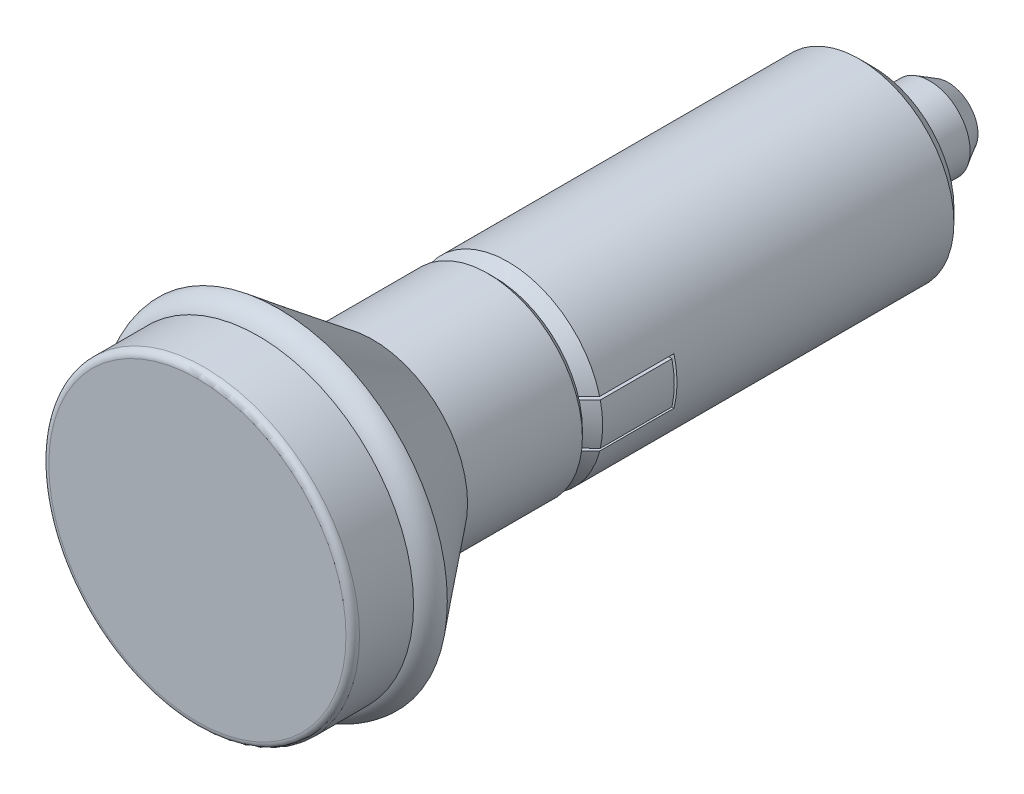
ISO-10303-21;
HEADER;
FILE_DESCRIPTION(('STEP AP214'),'2;1');
FILE_NAME('part.step','',(''),(''),'','','');
FILE_SCHEMA(('AUTOMOTIVE_DESIGN { 1 0 10303 214 1 1 1 1 }'));
ENDSEC;
DATA;
#1=APPLICATION_CONTEXT('core data for automotive mechanical design processes');
#2=APPLICATION_PROTOCOL_DEFINITION('international standard','automotive_design',2000,#1);
#3=PRODUCT_CONTEXT('',#1,'mechanical');
#4=PRODUCT('Part','Part','',(#3));
#5=PRODUCT_RELATED_PRODUCT_CATEGORY('part','',(#4));
#6=PRODUCT_DEFINITION_FORMATION('','',#4);
#7=PRODUCT_DEFINITION_CONTEXT('part definition',#1,'design');
#8=PRODUCT_DEFINITION('design','',#6,#7);
#9=PRODUCT_DEFINITION_SHAPE('','',#8);
#10=(LENGTH_UNIT() NAMED_UNIT(*) SI_UNIT(.MILLI.,.METRE.));
#11=(NAMED_UNIT(*) PLANE_ANGLE_UNIT() SI_UNIT($,.RADIAN.));
#12=(NAMED_UNIT(*) SI_UNIT($,.STERADIAN.) SOLID_ANGLE_UNIT());
#13=UNCERTAINTY_MEASURE_WITH_UNIT(LENGTH_MEASURE(1.E-05),#10,'distance_accuracy_value','');
#14=(GEOMETRIC_REPRESENTATION_CONTEXT(3) GLOBAL_UNCERTAINTY_ASSIGNED_CONTEXT((#13)) GLOBAL_UNIT_ASSIGNED_CONTEXT((#10,
#11,#12)) REPRESENTATION_CONTEXT('',''));
#15=CARTESIAN_POINT('',(0.,0.,0.));
#16=DIRECTION('',(0.,0.,1.));
#17=DIRECTION('',(1.,0.,0.));
#18=AXIS2_PLACEMENT_3D('',#15,#16,#17);
#19=CARTESIAN_POINT('',(0.,0.,27.9999999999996));
#20=DIRECTION('',(0.,0.,-1.));
#21=DIRECTION('',(-1.,0.,0.));
#22=AXIS2_PLACEMENT_3D('',#19,#20,#21);
#23=CONICAL_SURFACE('',#22,6.,0.785398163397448);
#24=CARTESIAN_POINT('',(0.,0.,26.9999999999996));
#25=DIRECTION('',(0.,0.,1.));
#26=DIRECTION('',(1.,0.,0.));
#27=AXIS2_PLACEMENT_3D('',#24,#25,#26);
#28=CIRCLE('',#27,7.);
#29=CARTESIAN_POINT('',(-6.77772085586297,-1.75,26.9999999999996));
#30=VERTEX_POINT('',#29);
#31=CARTESIAN_POINT('',(6.77772085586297,-1.75,26.9999999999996));
#32=VERTEX_POINT('',#31);
#33=EDGE_CURVE('E274',#30,#32,#28,.T.);
#34=ORIENTED_EDGE('',*,*,#33,.T.);
#35=CARTESIAN_POINT('',(11.806308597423,-1.75,22.0646984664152));
#36=CARTESIAN_POINT('',(11.3510637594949,-1.75,22.5149692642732));
#37=CARTESIAN_POINT('',(10.8955896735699,-1.75,22.9650092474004));
#38=CARTESIAN_POINT('',(9.98382441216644,-1.75,23.8642578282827));
#39=CARTESIAN_POINT('',(9.52753323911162,-1.75,24.3134664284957));
#40=CARTESIAN_POINT('',(8.61387315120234,-1.75,25.2105863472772));
#41=CARTESIAN_POINT('',(8.15650449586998,-1.75,25.6584979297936));
#42=CARTESIAN_POINT('',(7.46900337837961,-1.75,26.328887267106));
#43=CARTESIAN_POINT('',(7.23959330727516,-1.75,26.5521056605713));
#44=CARTESIAN_POINT('',(6.78013505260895,-1.75,26.9978845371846));
#45=CARTESIAN_POINT('',(6.55008686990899,-1.75,27.2204450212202));
#46=CARTESIAN_POINT('',(6.05652116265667,-1.75,27.6961117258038));
#47=CARTESIAN_POINT('',(5.79287414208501,-1.75,27.9490836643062));
#48=CARTESIAN_POINT('',(5.26397799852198,-1.75,28.4533312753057));
#49=CARTESIAN_POINT('',(4.99872893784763,-1.75,28.7046070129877));
#50=CARTESIAN_POINT('',(4.59896265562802,-1.75,29.0795479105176));
#51=CARTESIAN_POINT('',(4.465380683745,-1.75,29.2042096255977));
#52=CARTESIAN_POINT('',(4.19741399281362,-1.75,29.4526639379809));
#53=CARTESIAN_POINT('',(4.06302928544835,-1.75,29.5764565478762));
#54=CARTESIAN_POINT('',(3.79321215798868,-1.75,29.8229312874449));
#55=CARTESIAN_POINT('',(3.65777961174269,-1.75,29.9456132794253));
#56=CARTESIAN_POINT('',(3.38550244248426,-1.75,30.1894123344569));
#57=CARTESIAN_POINT('',(3.24865774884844,-1.75,30.310529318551));
#58=CARTESIAN_POINT('',(3.11092345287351,-1.75,30.4306380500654));
#59=B_SPLINE_CURVE_WITH_KNOTS('',3,(#35,#36,#37,#38,#39,#40,#41,#42,#43,#44,#45,#46,#47,#48,#49,
#50,#51,#52,#53,#54,#55,#56,#57,#58),.UNSPECIFIED.,.F.,.F.,(4,2,2,2,2,2,2,2,2,2,2,4),(0.,
1.92091856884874,3.84183144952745,5.76232122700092,6.72258010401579,7.68283768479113,
8.7789818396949,9.87508362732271,10.4232249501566,10.971358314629,11.5195587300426,
12.0677866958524),.UNSPECIFIED.);
#60=CARTESIAN_POINT('',(5.73912014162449,-1.75,27.9999999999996));
#61=VERTEX_POINT('',#60);
#62=EDGE_CURVE('E342',#32,#61,#59,.T.);
#63=ORIENTED_EDGE('',*,*,#62,.T.);
#64=CARTESIAN_POINT('',(0.,0.,27.9999999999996));
#65=DIRECTION('',(0.,0.,1.));
#66=DIRECTION('',(1.,0.,0.));
#67=AXIS2_PLACEMENT_3D('',#64,#65,#66);
#68=CIRCLE('',#67,6.);
#69=CARTESIAN_POINT('',(-5.73912014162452,-1.75,27.9999999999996));
#70=VERTEX_POINT('',#69);
#71=EDGE_CURVE('E279',#70,#61,#68,.T.);
#72=ORIENTED_EDGE('',*,*,#71,.F.);
#73=CARTESIAN_POINT('',(-10.6376253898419,-1.75,23.2193889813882));
#74=CARTESIAN_POINT('',(-10.4315589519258,-1.75,23.4227203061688));
#75=CARTESIAN_POINT('',(-10.2254167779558,-1.75,23.6259749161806));
#76=CARTESIAN_POINT('',(-9.81294587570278,-1.75,24.0322951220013));
#77=CARTESIAN_POINT('',(-9.60661714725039,-1.75,24.2353607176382));
#78=CARTESIAN_POINT('',(-8.98729385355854,-1.75,24.8442251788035));
#79=CARTESIAN_POINT('',(-8.57396738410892,-1.75,25.249686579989));
#80=CARTESIAN_POINT('',(-7.74610193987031,-1.75,26.0591581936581));
#81=CARTESIAN_POINT('',(-7.3315633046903,-1.75,26.463168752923));
#82=CARTESIAN_POINT('',(-6.70814620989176,-1.75,27.0675276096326));
#83=CARTESIAN_POINT('',(-6.50007172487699,-1.75,27.2687049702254));
#84=CARTESIAN_POINT('',(-6.0832118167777,-1.75,27.6703216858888));
#85=CARTESIAN_POINT('',(-5.87442639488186,-1.75,27.8707610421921));
#86=CARTESIAN_POINT('',(-5.45833219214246,-1.75,28.2683192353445));
#87=CARTESIAN_POINT('',(-5.25103443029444,-1.75,28.4654495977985));
#88=CARTESIAN_POINT('',(-4.83515975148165,-1.75,28.8583472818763));
#89=CARTESIAN_POINT('',(-4.62658287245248,-1.75,29.0541146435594));
#90=CARTESIAN_POINT('',(-4.31231196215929,-1.75,29.346285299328));
#91=CARTESIAN_POINT('',(-4.20731290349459,-1.75,29.4434359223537));
#92=CARTESIAN_POINT('',(-3.99674456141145,-1.75,29.637115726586));
#93=CARTESIAN_POINT('',(-3.89117528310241,-1.75,29.7336449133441));
#94=CARTESIAN_POINT('',(-3.67932633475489,-1.75,29.9259417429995));
#95=CARTESIAN_POINT('',(-3.57304660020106,-1.75,30.0217093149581));
#96=CARTESIAN_POINT('',(-3.35959032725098,-1.75,30.2122456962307));
#97=CARTESIAN_POINT('',(-3.25241376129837,-1.75,30.3070144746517));
#98=CARTESIAN_POINT('',(-3.14469403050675,-1.75,30.4011667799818));
#99=B_SPLINE_CURVE_WITH_KNOTS('',3,(#73,#74,#75,#76,#77,#78,#79,#80,#81,#82,#83,#84,#85,#86,#87,
#88,#89,#90,#91,#92,#93,#94,#95,#96,#97,#98),.UNSPECIFIED.,.F.,.F.,(4,2,2,2,2,2,2,2,2,2,2,2,4),
(0.,0.868483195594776,1.73696718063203,3.47395709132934,5.21049974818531,6.07877603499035,
6.94705087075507,7.8052398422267,8.66340348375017,9.09254883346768,9.52169034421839,
9.95087136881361,10.380065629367),.UNSPECIFIED.);
#100=EDGE_CURVE('E413',#30,#70,#99,.T.);
#101=ORIENTED_EDGE('',*,*,#100,.F.);
#102=EDGE_LOOP('',(#34,#63,#72,#101));
#103=FACE_BOUND('',#102,.T.);
#104=ADVANCED_FACE('F14',(#103),#23,.T.);
#105=CARTESIAN_POINT('',(5.79633504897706,-1.55,27.9999999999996));
#106=VERTEX_POINT('',#105);
#107=CARTESIAN_POINT('',(5.79633504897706,1.55,27.9999999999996));
#108=VERTEX_POINT('',#107);
#109=EDGE_CURVE('E283',#106,#108,#68,.T.);
#110=ORIENTED_EDGE('',*,*,#109,.F.);
#111=CARTESIAN_POINT('',(2.46323333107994,-1.55,31.0896703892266));
#112=CARTESIAN_POINT('',(2.57178180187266,-1.55,30.9977428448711));
#113=CARTESIAN_POINT('',(2.67952953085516,-1.55,30.9048825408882));
#114=CARTESIAN_POINT('',(2.89374241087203,-1.55,30.7177073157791));
#115=CARTESIAN_POINT('',(3.000207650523,-1.55,30.6233924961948));
#116=CARTESIAN_POINT('',(3.21217227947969,-1.55,30.4337216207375));
#117=CARTESIAN_POINT('',(3.31767182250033,-1.55,30.3383657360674));
#118=CARTESIAN_POINT('',(3.52792710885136,-1.55,30.1468338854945));
#119=CARTESIAN_POINT('',(3.63268283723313,-1.55,30.050657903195));
#120=CARTESIAN_POINT('',(3.94602010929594,-1.55,29.7612350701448));
#121=CARTESIAN_POINT('',(4.15372777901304,-1.55,29.5670428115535));
#122=CARTESIAN_POINT('',(4.56762785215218,-1.55,29.1770377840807));
#123=CARTESIAN_POINT('',(4.77382019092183,-1.55,28.9812249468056));
#124=CARTESIAN_POINT('',(5.09376751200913,-1.55,28.675732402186));
#125=CARTESIAN_POINT('',(5.20789003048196,-1.55,28.566437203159));
#126=CARTESIAN_POINT('',(5.43585922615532,-1.55,28.3475626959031));
#127=CARTESIAN_POINT('',(5.5497059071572,-1.55,28.2379833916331));
#128=CARTESIAN_POINT('',(5.89092091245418,-1.55,27.9088719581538));
#129=CARTESIAN_POINT('',(6.11794584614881,-1.55,27.6889838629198));
#130=CARTESIAN_POINT('',(6.80211048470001,-1.55,27.0243787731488));
#131=CARTESIAN_POINT('',(7.25825730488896,-1.55,26.5786404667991));
#132=CARTESIAN_POINT('',(8.16907069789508,-1.55,25.6856533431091));
#133=CARTESIAN_POINT('',(8.62373726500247,-1.55,25.2384045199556));
#134=CARTESIAN_POINT('',(9.53199750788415,-1.55,24.3431073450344));
#135=CARTESIAN_POINT('',(9.98559147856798,-1.55,23.8950592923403));
#136=CARTESIAN_POINT('',(10.8921339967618,-1.55,22.9983203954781));
#137=CARTESIAN_POINT('',(11.3450825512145,-1.55,22.5496295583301));
#138=CARTESIAN_POINT('',(11.7978546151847,-1.55,22.1007616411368));
#139=B_SPLINE_CURVE_WITH_KNOTS('',3,(#111,#112,#113,#114,#115,#116,#117,#118,#119,#120,#121,
#122,#123,#124,#125,#126,#127,#128,#129,#130,#131,#132,#133,#134,#135,#136,#137,#138),
.UNSPECIFIED.,.F.,.F.,(4,2,2,2,2,2,2,2,2,2,2,2,2,4),(0.,0.426715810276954,0.853401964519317,
1.28001897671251,1.70664453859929,2.55966932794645,3.41273030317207,3.8867809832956,
4.36082509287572,5.30898950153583,7.22229676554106,9.13561140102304,11.0483183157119,
12.9610044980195),.UNSPECIFIED.);
#140=CARTESIAN_POINT('',(6.82623615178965,-1.55,26.9999999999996));
#141=VERTEX_POINT('',#140);
#142=EDGE_CURVE('E335',#106,#141,#139,.T.);
#143=ORIENTED_EDGE('',*,*,#142,.T.);
#144=CARTESIAN_POINT('',(6.82623615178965,1.55,26.9999999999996));
#145=VERTEX_POINT('',#144);
#146=EDGE_CURVE('E278',#141,#145,#28,.T.);
#147=ORIENTED_EDGE('',*,*,#146,.T.);
#148=CARTESIAN_POINT('',(11.7978546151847,1.55,22.1007616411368));
#149=CARTESIAN_POINT('',(11.3449521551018,1.55,22.5497594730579));
#150=CARTESIAN_POINT('',(10.8918726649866,1.55,22.9985795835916));
#151=CARTESIAN_POINT('',(9.98508449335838,1.55,23.8955600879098));
#152=CARTESIAN_POINT('',(9.53137582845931,1.55,24.3437204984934));
#153=CARTESIAN_POINT('',(8.62313128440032,1.55,25.2390015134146));
#154=CARTESIAN_POINT('',(8.168595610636,1.55,25.686122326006));
#155=CARTESIAN_POINT('',(7.25802529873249,1.55,26.5788647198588));
#156=CARTESIAN_POINT('',(6.80199061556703,1.55,27.0244862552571));
#157=CARTESIAN_POINT('',(6.02735655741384,1.55,27.776989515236));
#158=CARTESIAN_POINT('',(5.70943580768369,1.55,28.0845686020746));
#159=CARTESIAN_POINT('',(5.23103433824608,1.55,28.5443326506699));
#160=CARTESIAN_POINT('',(5.07131965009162,1.55,28.6973143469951));
#161=CARTESIAN_POINT('',(4.75121738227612,1.55,29.0025772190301));
#162=CARTESIAN_POINT('',(4.5908297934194,1.55,29.1548583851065));
#163=CARTESIAN_POINT('',(4.26912295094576,1.55,29.4585148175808));
#164=CARTESIAN_POINT('',(4.10780347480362,1.55,29.6098898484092));
#165=CARTESIAN_POINT('',(3.7839499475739,1.55,29.9113265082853));
#166=CARTESIAN_POINT('',(3.62141594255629,1.55,30.0613881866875));
#167=CARTESIAN_POINT('',(3.37628877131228,1.55,30.2850680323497));
#168=CARTESIAN_POINT('',(3.29434856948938,1.55,30.3594015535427));
#169=CARTESIAN_POINT('',(3.12993609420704,1.55,30.5074761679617));
#170=CARTESIAN_POINT('',(3.04746382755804,1.55,30.5812172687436));
#171=CARTESIAN_POINT('',(2.88185934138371,1.55,30.7279776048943));
#172=CARTESIAN_POINT('',(2.7987270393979,1.55,30.800996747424));
#173=CARTESIAN_POINT('',(2.63163921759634,1.55,30.946093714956));
#174=CARTESIAN_POINT('',(2.54768366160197,1.55,31.018171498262));
#175=CARTESIAN_POINT('',(2.46323333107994,1.55,31.0896703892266));
#176=B_SPLINE_CURVE_WITH_KNOTS('',3,(#148,#149,#150,#151,#152,#153,#154,#155,#156,#157,#158,
#159,#160,#161,#162,#163,#164,#165,#166,#167,#168,#169,#170,#171,#172,#173,#174,#175),
.UNSPECIFIED.,.F.,.F.,(4,2,2,2,2,2,2,2,2,2,2,2,2,4),(0.,1.91323824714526,3.8264269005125,
5.73919195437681,7.65201499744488,8.97907477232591,9.64255621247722,10.3060467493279,
10.9697028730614,11.6333339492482,11.9652308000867,12.2971234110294,12.6290581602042,
12.9610075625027),.UNSPECIFIED.);
#177=EDGE_CURVE('E209',#145,#108,#176,.T.);
#178=ORIENTED_EDGE('',*,*,#177,.T.);
#179=EDGE_LOOP('',(#110,#143,#147,#178));
#180=FACE_BOUND('',#179,.T.);
#181=ADVANCED_FACE('F339',(#180),#23,.T.);
#182=CARTESIAN_POINT('',(5.73912014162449,1.75,27.9999999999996));
#183=VERTEX_POINT('',#182);
#184=CARTESIAN_POINT('',(-5.73912014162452,1.75,27.9999999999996));
#185=VERTEX_POINT('',#184);
#186=EDGE_CURVE('E284',#183,#185,#68,.T.);
#187=ORIENTED_EDGE('',*,*,#186,.F.);
#188=CARTESIAN_POINT('',(3.11092345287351,1.75,30.4306380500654));
#189=CARTESIAN_POINT('',(3.24865774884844,1.75,30.310529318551));
#190=CARTESIAN_POINT('',(3.38550244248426,1.75,30.1894123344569));
#191=CARTESIAN_POINT('',(3.65777961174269,1.75,29.9456132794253));
#192=CARTESIAN_POINT('',(3.79321215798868,1.75,29.8229312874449));
#193=CARTESIAN_POINT('',(4.06302928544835,1.75,29.5764565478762));
#194=CARTESIAN_POINT('',(4.19741399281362,1.75,29.4526639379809));
#195=CARTESIAN_POINT('',(4.465380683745,1.75,29.2042096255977));
#196=CARTESIAN_POINT('',(4.59896265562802,1.75,29.0795479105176));
#197=CARTESIAN_POINT('',(4.99872893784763,1.75,28.7046070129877));
#198=CARTESIAN_POINT('',(5.26397799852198,1.75,28.4533312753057));
#199=CARTESIAN_POINT('',(5.79287414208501,1.75,27.9490836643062));
#200=CARTESIAN_POINT('',(6.05652116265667,1.75,27.6961117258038));
#201=CARTESIAN_POINT('',(6.55008686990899,1.75,27.2204450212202));
#202=CARTESIAN_POINT('',(6.78013505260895,1.75,26.9978845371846));
#203=CARTESIAN_POINT('',(7.23959330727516,1.75,26.5521056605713));
#204=CARTESIAN_POINT('',(7.46900337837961,1.75,26.328887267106));
#205=CARTESIAN_POINT('',(8.15650449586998,1.75,25.6584979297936));
#206=CARTESIAN_POINT('',(8.61387315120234,1.75,25.2105863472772));
#207=CARTESIAN_POINT('',(9.52753323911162,1.75,24.3134664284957));
#208=CARTESIAN_POINT('',(9.98382441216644,1.75,23.8642578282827));
#209=CARTESIAN_POINT('',(10.8955896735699,1.75,22.9650092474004));
#210=CARTESIAN_POINT('',(11.3510637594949,1.75,22.5149692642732));
#211=CARTESIAN_POINT('',(11.806308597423,1.75,22.0646984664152));
#212=B_SPLINE_CURVE_WITH_KNOTS('',3,(#188,#189,#190,#191,#192,#193,#194,#195,#196,#197,#198,
#199,#200,#201,#202,#203,#204,#205,#206,#207,#208,#209,#210,#211),.UNSPECIFIED.,.F.,.F.,(4,2,2,
2,2,2,2,2,2,2,2,4),(0.,0.548227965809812,1.0964283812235,1.64456174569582,2.19270306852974,
3.28880485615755,4.38494901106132,5.34520659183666,6.30546546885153,8.22595524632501,
10.1468681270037,12.0677866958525),.UNSPECIFIED.);
#213=CARTESIAN_POINT('',(6.77772085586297,1.75,26.9999999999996));
#214=VERTEX_POINT('',#213);
#215=EDGE_CURVE('E186',#183,#214,#212,.T.);
#216=ORIENTED_EDGE('',*,*,#215,.T.);
#217=CARTESIAN_POINT('',(-6.77772085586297,1.75,26.9999999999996));
#218=VERTEX_POINT('',#217);
#219=EDGE_CURVE('E273',#214,#218,#28,.T.);
#220=ORIENTED_EDGE('',*,*,#219,.T.);
#221=CARTESIAN_POINT('',(-3.14469403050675,1.75,30.4011667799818));
#222=CARTESIAN_POINT('',(-3.25241375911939,1.75,30.3070144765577));
#223=CARTESIAN_POINT('',(-3.3595903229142,1.75,30.2122457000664));
#224=CARTESIAN_POINT('',(-3.57304659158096,1.75,30.0217093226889));
#225=CARTESIAN_POINT('',(-3.6793263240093,1.75,29.9259417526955));
#226=CARTESIAN_POINT('',(-3.89117526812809,1.75,29.7336449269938));
#227=CARTESIAN_POINT('',(-3.99674454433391,1.75,29.6371157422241));
#228=CARTESIAN_POINT('',(-4.2073128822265,1.75,29.4434359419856));
#229=CARTESIAN_POINT('',(-4.31231193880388,1.75,29.3462853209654));
#230=CARTESIAN_POINT('',(-4.62658284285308,1.75,29.0541146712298));
#231=CARTESIAN_POINT('',(-4.83515971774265,1.75,28.8583473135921));
#232=CARTESIAN_POINT('',(-5.25103438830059,1.75,28.4654496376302));
#233=CARTESIAN_POINT('',(-5.45833214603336,1.75,28.2683192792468));
#234=CARTESIAN_POINT('',(-5.87442634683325,1.75,27.8707610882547));
#235=CARTESIAN_POINT('',(-6.08321177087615,1.75,27.6703217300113));
#236=CARTESIAN_POINT('',(-6.50007168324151,1.75,27.2687050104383));
#237=CARTESIAN_POINT('',(-6.70814617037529,1.75,27.0675276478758));
#238=CARTESIAN_POINT('',(-7.33156327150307,1.75,26.4631687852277));
#239=CARTESIAN_POINT('',(-7.74610191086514,1.75,26.0591582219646));
#240=CARTESIAN_POINT('',(-8.57396736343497,1.75,25.2496866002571));
#241=CARTESIAN_POINT('',(-8.98729383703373,1.75,24.8442251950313));
#242=CARTESIAN_POINT('',(-9.60661713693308,1.75,24.2353607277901));
#243=CARTESIAN_POINT('',(-9.81294586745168,1.75,24.0322951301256));
#244=CARTESIAN_POINT('',(-10.225416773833,1.75,23.6259749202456));
#245=CARTESIAN_POINT('',(-10.4315589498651,1.75,23.422720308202));
#246=CARTESIAN_POINT('',(-10.6376253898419,1.75,23.2193889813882));
#247=B_SPLINE_CURVE_WITH_KNOTS('',3,(#221,#222,#223,#224,#225,#226,#227,#228,#229,#230,#231,
#232,#233,#234,#235,#236,#237,#238,#239,#240,#241,#242,#243,#244,#245,#246),.UNSPECIFIED.,.F.,
.F.,(4,2,2,2,2,2,2,2,2,2,2,2,4),(0.,0.429194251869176,0.858375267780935,1.28751676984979,
1.71666211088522,2.57482573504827,3.43301468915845,4.30128953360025,5.16956582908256,
6.90610850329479,8.64309843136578,9.51158242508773,10.3800656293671),.UNSPECIFIED.);
#248=EDGE_CURVE('E244',#185,#218,#247,.T.);
#249=ORIENTED_EDGE('',*,*,#248,.F.);
#250=EDGE_LOOP('',(#187,#216,#220,#249));
#251=FACE_BOUND('',#250,.T.);
#252=ADVANCED_FACE('F374',(#251),#23,.T.);
#253=CARTESIAN_POINT('',(0.,0.,50.));
#254=DIRECTION('',(0.,0.,1.));
#255=DIRECTION('',(1.,0.,0.));
#256=AXIS2_PLACEMENT_3D('',#253,#254,#255);
#257=CYLINDRICAL_SURFACE('',#256,7.);
#258=CARTESIAN_POINT('',(0.,0.,1.));
#259=DIRECTION('',(0.,0.,1.));
#260=DIRECTION('',(1.,0.,0.));
#261=AXIS2_PLACEMENT_3D('',#258,#259,#260);
#262=CIRCLE('',#261,7.);
#263=CARTESIAN_POINT('',(7.,0.,1.));
#264=VERTEX_POINT('',#263);
#265=EDGE_CURVE('E270',#264,#264,#262,.T.);
#266=ORIENTED_EDGE('',*,*,#265,.T.);
#267=EDGE_LOOP('',(#266));
#268=FACE_BOUND('',#267,.T.);
#269=CARTESIAN_POINT('',(0.,0.,21.5));
#270=DIRECTION('',(0.,0.,1.));
#271=DIRECTION('',(1.,0.,0.));
#272=AXIS2_PLACEMENT_3D('',#269,#270,#271);
#273=CIRCLE('',#272,7.);
#274=CARTESIAN_POINT('',(6.77772085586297,1.75,21.5));
#275=VERTEX_POINT('',#274);
#276=CARTESIAN_POINT('',(6.77772085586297,-1.75,21.5));
#277=VERTEX_POINT('',#276);
#278=EDGE_CURVE('E166',#275,#277,#273,.F.);
#279=ORIENTED_EDGE('',*,*,#278,.T.);
#280=DIRECTION('',(0.,0.,1.));
#281=VECTOR('',#280,1.);
#282=CARTESIAN_POINT('',(6.77772085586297,-1.75,50.));
#283=LINE('',#282,#281);
#284=EDGE_CURVE('E9',#277,#32,#283,.T.);
#285=ORIENTED_EDGE('',*,*,#284,.T.);
#286=ORIENTED_EDGE('',*,*,#33,.F.);
#287=DIRECTION('',(0.,0.,1.));
#288=VECTOR('',#287,1.);
#289=CARTESIAN_POINT('',(-6.77772085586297,-1.75,50.));
#290=LINE('',#289,#288);
#291=CARTESIAN_POINT('',(-6.77772085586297,-1.75,21.5));
#292=VERTEX_POINT('',#291);
#293=EDGE_CURVE('E313',#292,#30,#290,.T.);
#294=ORIENTED_EDGE('',*,*,#293,.F.);
#295=CARTESIAN_POINT('',(0.,0.,21.5));
#296=DIRECTION('',(0.,0.,-1.));
#297=DIRECTION('',(-1.,0.,0.));
#298=AXIS2_PLACEMENT_3D('',#295,#296,#297);
#299=CIRCLE('',#298,7.);
#300=CARTESIAN_POINT('',(-6.77772085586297,1.75,21.5));
#301=VERTEX_POINT('',#300);
#302=EDGE_CURVE('E37',#301,#292,#299,.F.);
#303=ORIENTED_EDGE('',*,*,#302,.F.);
#304=DIRECTION('',(0.,0.,1.));
#305=VECTOR('',#304,1.);
#306=CARTESIAN_POINT('',(-6.77772085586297,1.75,50.));
#307=LINE('',#306,#305);
#308=EDGE_CURVE('E311',#218,#301,#307,.F.);
#309=ORIENTED_EDGE('',*,*,#308,.F.);
#310=ORIENTED_EDGE('',*,*,#219,.F.);
#311=DIRECTION('',(0.,0.,1.));
#312=VECTOR('',#311,1.);
#313=CARTESIAN_POINT('',(6.77772085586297,1.75,50.));
#314=LINE('',#313,#312);
#315=EDGE_CURVE('E322',#214,#275,#314,.F.);
#316=ORIENTED_EDGE('',*,*,#315,.T.);
#317=EDGE_LOOP('',(#279,#285,#286,#294,#303,#309,#310,#316));
#318=FACE_BOUND('',#317,.T.);
#319=ADVANCED_FACE('F390',(#268,#318),#257,.T.);
#320=ORIENTED_EDGE('',*,*,#146,.F.);
#321=DIRECTION('',(0.,0.,1.));
#322=VECTOR('',#321,1.);
#323=CARTESIAN_POINT('',(6.82623615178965,-1.55,50.));
#324=LINE('',#323,#322);
#325=CARTESIAN_POINT('',(6.82623615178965,-1.55,21.7));
#326=VERTEX_POINT('',#325);
#327=EDGE_CURVE('E22',#141,#326,#324,.F.);
#328=ORIENTED_EDGE('',*,*,#327,.T.);
#329=CARTESIAN_POINT('',(0.,0.,21.7));
#330=DIRECTION('',(0.,0.,-1.));
#331=DIRECTION('',(-1.,0.,0.));
#332=AXIS2_PLACEMENT_3D('',#329,#330,#331);
#333=CIRCLE('',#332,7.);
#334=CARTESIAN_POINT('',(6.82623615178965,1.55,21.7));
#335=VERTEX_POINT('',#334);
#336=EDGE_CURVE('E318',#326,#335,#333,.F.);
#337=ORIENTED_EDGE('',*,*,#336,.T.);
#338=DIRECTION('',(0.,0.,1.));
#339=VECTOR('',#338,1.);
#340=CARTESIAN_POINT('',(6.82623615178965,1.55,50.));
#341=LINE('',#340,#339);
#342=EDGE_CURVE('E324',#335,#145,#341,.T.);
#343=ORIENTED_EDGE('',*,*,#342,.T.);
#344=EDGE_LOOP('',(#320,#328,#337,#343));
#345=FACE_BOUND('',#344,.T.);
#346=ADVANCED_FACE('F329',(#345),#257,.T.);
#347=CARTESIAN_POINT('',(0.,0.,21.7));
#348=DIRECTION('',(0.,0.,1.));
#349=DIRECTION('',(1.,0.,0.));
#350=AXIS2_PLACEMENT_3D('',#347,#348,#349);
#351=CIRCLE('',#350,7.);
#352=CARTESIAN_POINT('',(-6.82623615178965,-1.55,21.7));
#353=VERTEX_POINT('',#352);
#354=CARTESIAN_POINT('',(-6.82623615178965,1.55,21.7));
#355=VERTEX_POINT('',#354);
#356=EDGE_CURVE('E306',#353,#355,#351,.F.);
#357=ORIENTED_EDGE('',*,*,#356,.F.);
#358=DIRECTION('',(0.,0.,1.));
#359=VECTOR('',#358,1.);
#360=CARTESIAN_POINT('',(-6.82623615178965,-1.55,50.));
#361=LINE('',#360,#359);
#362=CARTESIAN_POINT('',(-6.82623615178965,-1.55,26.9999999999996));
#363=VERTEX_POINT('',#362);
#364=EDGE_CURVE('E315',#363,#353,#361,.F.);
#365=ORIENTED_EDGE('',*,*,#364,.F.);
#366=CARTESIAN_POINT('',(-6.82623615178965,1.55,26.9999999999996));
#367=VERTEX_POINT('',#366);
#368=EDGE_CURVE('E277',#367,#363,#28,.T.);
#369=ORIENTED_EDGE('',*,*,#368,.F.);
#370=DIRECTION('',(0.,0.,1.));
#371=VECTOR('',#370,1.);
#372=CARTESIAN_POINT('',(-6.82623615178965,1.55,50.));
#373=LINE('',#372,#371);
#374=EDGE_CURVE('E308',#355,#367,#373,.T.);
#375=ORIENTED_EDGE('',*,*,#374,.F.);
#376=EDGE_LOOP('',(#357,#365,#369,#375));
#377=FACE_BOUND('',#376,.T.);
#378=ADVANCED_FACE('F396',(#377),#257,.T.);
#379=CARTESIAN_POINT('',(0.,0.,0.));
#380=DIRECTION('',(0.,0.,1.));
#381=DIRECTION('',(0.,1.,0.));
#382=AXIS2_PLACEMENT_3D('',#379,#380,#381);
#383=SPHERICAL_SURFACE('',#382,6.00000000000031);
#384=CARTESIAN_POINT('',(0.,0.,-5.58107460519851));
#385=DIRECTION('',(0.,0.,1.));
#386=DIRECTION('',(1.,0.,0.));
#387=AXIS2_PLACEMENT_3D('',#384,#385,#386);
#388=CIRCLE('',#387,2.2026362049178);
#389=CARTESIAN_POINT('',(2.2026362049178,0.,-5.58107460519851));
#390=VERTEX_POINT('',#389);
#391=EDGE_CURVE('E252',#390,#390,#388,.T.);
#392=ORIENTED_EDGE('',*,*,#391,.F.);
#393=EDGE_LOOP('',(#392));
#394=FACE_BOUND('',#393,.T.);
#395=ADVANCED_FACE('F16',(#394),#383,.T.);
#396=CARTESIAN_POINT('',(0.,0.,50.));
#397=DIRECTION('',(0.,0.,1.));
#398=DIRECTION('',(1.,0.,0.));
#399=AXIS2_PLACEMENT_3D('',#396,#397,#398);
#400=PLANE('',#399);
#401=CARTESIAN_POINT('',(0.,0.,50.));
#402=DIRECTION('',(0.,0.,1.));
#403=DIRECTION('',(1.,0.,0.));
#404=AXIS2_PLACEMENT_3D('',#401,#402,#403);
#405=CIRCLE('',#404,10.9999999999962);
#406=CARTESIAN_POINT('',(10.9999999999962,0.,50.));
#407=VERTEX_POINT('',#406);
#408=EDGE_CURVE('E303',#407,#407,#405,.T.);
#409=ORIENTED_EDGE('',*,*,#408,.T.);
#410=EDGE_LOOP('',(#409));
#411=FACE_BOUND('',#410,.T.);
#412=ADVANCED_FACE('F617',(#411),#400,.T.);
#413=CARTESIAN_POINT('',(0.,0.,49.5));
#414=DIRECTION('',(0.,0.,1.));
#415=DIRECTION('',(1.,0.,0.));
#416=AXIS2_PLACEMENT_3D('',#413,#414,#415);
#417=TOROIDAL_SURFACE('',#416,10.9999999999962,0.5);
#418=CARTESIAN_POINT('',(0.,0.,49.5));
#419=DIRECTION('',(0.,0.,1.));
#420=DIRECTION('',(1.,0.,0.));
#421=AXIS2_PLACEMENT_3D('',#418,#419,#420);
#422=CIRCLE('',#421,11.4999999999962);
#423=CARTESIAN_POINT('',(11.4999999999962,0.,49.5));
#424=VERTEX_POINT('',#423);
#425=EDGE_CURVE('E300',#424,#424,#422,.T.);
#426=ORIENTED_EDGE('',*,*,#425,.T.);
#427=EDGE_LOOP('',(#426));
#428=FACE_BOUND('',#427,.T.);
#429=ORIENTED_EDGE('',*,*,#408,.F.);
#430=EDGE_LOOP('',(#429));
#431=FACE_BOUND('',#430,.T.);
#432=ADVANCED_FACE('F608',(#428,#431),#417,.T.);
#433=CARTESIAN_POINT('',(0.,0.,50.));
#434=DIRECTION('',(0.,0.,1.));
#435=DIRECTION('',(1.,0.,0.));
#436=AXIS2_PLACEMENT_3D('',#433,#434,#435);
#437=CYLINDRICAL_SURFACE('',#436,11.4999999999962);
#438=CARTESIAN_POINT('',(0.,0.,45.5000000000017));
#439=DIRECTION('',(0.,0.,1.));
#440=DIRECTION('',(1.,0.,0.));
#441=AXIS2_PLACEMENT_3D('',#438,#439,#440);
#442=CIRCLE('',#441,11.4999999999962);
#443=CARTESIAN_POINT('',(11.4999999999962,0.,45.5000000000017));
#444=VERTEX_POINT('',#443);
#445=EDGE_CURVE('E297',#444,#444,#442,.T.);
#446=ORIENTED_EDGE('',*,*,#445,.T.);
#447=EDGE_LOOP('',(#446));
#448=FACE_BOUND('',#447,.T.);
#449=ORIENTED_EDGE('',*,*,#425,.F.);
#450=EDGE_LOOP('',(#449));
#451=FACE_BOUND('',#450,.T.);
#452=ADVANCED_FACE('F599',(#448,#451),#437,.T.);
#453=CARTESIAN_POINT('',(0.,0.,44.));
#454=DIRECTION('',(0.,0.,1.));
#455=DIRECTION('',(1.,0.,0.));
#456=AXIS2_PLACEMENT_3D('',#453,#454,#455);
#457=TOROIDAL_SURFACE('',#456,10.8749999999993,1.62500000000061);
#458=CARTESIAN_POINT('',(0.,0.,43.9999999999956));
#459=DIRECTION('',(0.,0.,1.));
#460=DIRECTION('',(1.,0.,0.));
#461=AXIS2_PLACEMENT_3D('',#458,#459,#460);
#462=CIRCLE('',#461,12.5);
#463=CARTESIAN_POINT('',(12.5,0.,43.9999999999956));
#464=VERTEX_POINT('',#463);
#465=EDGE_CURVE('E294',#464,#464,#462,.T.);
#466=ORIENTED_EDGE('',*,*,#465,.T.);
#467=EDGE_LOOP('',(#466));
#468=FACE_BOUND('',#467,.T.);
#469=ORIENTED_EDGE('',*,*,#445,.F.);
#470=EDGE_LOOP('',(#469));
#471=FACE_BOUND('',#470,.T.);
#472=ADVANCED_FACE('F590',(#468,#471),#457,.T.);
#473=CARTESIAN_POINT('',(0.,0.,43.9999999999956));
#474=DIRECTION('',(0.,0.,1.));
#475=DIRECTION('',(1.,0.,0.));
#476=AXIS2_PLACEMENT_3D('',#473,#474,#475);
#477=CONICAL_SURFACE('',#476,12.5,0.665969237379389);
#478=CARTESIAN_POINT('',(0.,0.,37.));
#479=DIRECTION('',(0.,0.,1.));
#480=DIRECTION('',(1.,0.,0.));
#481=AXIS2_PLACEMENT_3D('',#478,#479,#480);
#482=CIRCLE('',#481,7.);
#483=CARTESIAN_POINT('',(7.,0.,37.));
#484=VERTEX_POINT('',#483);
#485=EDGE_CURVE('E291',#484,#484,#482,.T.);
#486=ORIENTED_EDGE('',*,*,#485,.T.);
#487=EDGE_LOOP('',(#486));
#488=FACE_BOUND('',#487,.T.);
#489=ORIENTED_EDGE('',*,*,#465,.F.);
#490=EDGE_LOOP('',(#489));
#491=FACE_BOUND('',#490,.T.);
#492=ADVANCED_FACE('F581',(#488,#491),#477,.T.);
#493=CARTESIAN_POINT('',(0.,0.,50.));
#494=DIRECTION('',(0.,0.,1.));
#495=DIRECTION('',(1.,0.,0.));
#496=AXIS2_PLACEMENT_3D('',#493,#494,#495);
#497=CYLINDRICAL_SURFACE('',#496,7.);
#498=CARTESIAN_POINT('',(0.,0.,28.4999999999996));
#499=DIRECTION('',(0.,0.,1.));
#500=DIRECTION('',(1.,0.,0.));
#501=AXIS2_PLACEMENT_3D('',#498,#499,#500);
#502=CIRCLE('',#501,7.);
#503=CARTESIAN_POINT('',(7.,0.,28.4999999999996));
#504=VERTEX_POINT('',#503);
#505=EDGE_CURVE('E288',#504,#504,#502,.T.);
#506=ORIENTED_EDGE('',*,*,#505,.T.);
#507=EDGE_LOOP('',(#506));
#508=FACE_BOUND('',#507,.T.);
#509=ORIENTED_EDGE('',*,*,#485,.F.);
#510=EDGE_LOOP('',(#509));
#511=FACE_BOUND('',#510,.T.);
#512=ADVANCED_FACE('F571',(#508,#511),#497,.T.);
#513=CARTESIAN_POINT('',(0.,0.,28.4999999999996));
#514=DIRECTION('',(0.,0.,1.));
#515=DIRECTION('',(1.,0.,0.));
#516=AXIS2_PLACEMENT_3D('',#513,#514,#515);
#517=CONICAL_SURFACE('',#516,7.,0.785398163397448);
#518=CARTESIAN_POINT('',(0.,0.,27.9999999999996));
#519=DIRECTION('',(0.,0.,1.));
#520=DIRECTION('',(1.,0.,0.));
#521=AXIS2_PLACEMENT_3D('',#518,#519,#520);
#522=CIRCLE('',#521,6.5);
#523=CARTESIAN_POINT('',(6.5,0.,27.9999999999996));
#524=VERTEX_POINT('',#523);
#525=EDGE_CURVE('E285',#524,#524,#522,.T.);
#526=ORIENTED_EDGE('',*,*,#525,.T.);
#527=EDGE_LOOP('',(#526));
#528=FACE_BOUND('',#527,.T.);
#529=ORIENTED_EDGE('',*,*,#505,.F.);
#530=EDGE_LOOP('',(#529));
#531=FACE_BOUND('',#530,.T.);
#532=ADVANCED_FACE('F386',(#528,#531),#517,.T.);
#533=CARTESIAN_POINT('',(0.,6.,27.9999999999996));
#534=DIRECTION('',(0.,0.,-1.));
#535=DIRECTION('',(-1.,0.,0.));
#536=AXIS2_PLACEMENT_3D('',#533,#534,#535);
#537=PLANE('',#536);
#538=ORIENTED_EDGE('',*,*,#525,.F.);
#539=EDGE_LOOP('',(#538));
#540=FACE_BOUND('',#539,.T.);
#541=ORIENTED_EDGE('',*,*,#71,.T.);
#542=DIRECTION('',(1.,0.,0.));
#543=VECTOR('',#542,1.);
#544=CARTESIAN_POINT('',(2.,-1.75,27.9999999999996));
#545=LINE('',#544,#543);
#546=CARTESIAN_POINT('',(2.,-1.75,27.9999999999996));
#547=VERTEX_POINT('',#546);
#548=EDGE_CURVE('E187',#547,#61,#545,.T.);
#549=ORIENTED_EDGE('',*,*,#548,.F.);
#550=DIRECTION('',(0.,1.,0.));
#551=VECTOR('',#550,1.);
#552=CARTESIAN_POINT('',(2.,-1.75,27.9999999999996));
#553=LINE('',#552,#551);
#554=CARTESIAN_POINT('',(2.,-1.55,27.9999999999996));
#555=VERTEX_POINT('',#554);
#556=EDGE_CURVE('E181',#547,#555,#553,.T.);
#557=ORIENTED_EDGE('',*,*,#556,.T.);
#558=DIRECTION('',(1.,0.,0.));
#559=VECTOR('',#558,1.);
#560=CARTESIAN_POINT('',(2.,-1.55,27.9999999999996));
#561=LINE('',#560,#559);
#562=EDGE_CURVE('E189',#555,#106,#561,.T.);
#563=ORIENTED_EDGE('',*,*,#562,.T.);
#564=ORIENTED_EDGE('',*,*,#109,.T.);
#565=DIRECTION('',(1.,0.,0.));
#566=VECTOR('',#565,1.);
#567=CARTESIAN_POINT('',(2.,1.55,27.9999999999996));
#568=LINE('',#567,#566);
#569=CARTESIAN_POINT('',(2.,1.55,27.9999999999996));
#570=VERTEX_POINT('',#569);
#571=EDGE_CURVE('E198',#570,#108,#568,.T.);
#572=ORIENTED_EDGE('',*,*,#571,.F.);
#573=DIRECTION('',(0.,1.,0.));
#574=VECTOR('',#573,1.);
#575=CARTESIAN_POINT('',(2.,1.75,27.9999999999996));
#576=LINE('',#575,#574);
#577=CARTESIAN_POINT('',(2.,1.75,27.9999999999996));
#578=VERTEX_POINT('',#577);
#579=EDGE_CURVE('E158',#570,#578,#576,.T.);
#580=ORIENTED_EDGE('',*,*,#579,.T.);
#581=DIRECTION('',(1.,0.,0.));
#582=VECTOR('',#581,1.);
#583=CARTESIAN_POINT('',(2.,1.75,27.9999999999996));
#584=LINE('',#583,#582);
#585=EDGE_CURVE('E154',#578,#183,#584,.T.);
#586=ORIENTED_EDGE('',*,*,#585,.T.);
#587=ORIENTED_EDGE('',*,*,#186,.T.);
#588=DIRECTION('',(-1.,0.,0.));
#589=VECTOR('',#588,1.);
#590=CARTESIAN_POINT('',(-2.,1.75,27.9999999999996));
#591=LINE('',#590,#589);
#592=CARTESIAN_POINT('',(-2.,1.75,27.9999999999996));
#593=VERTEX_POINT('',#592);
#594=EDGE_CURVE('E408',#593,#185,#591,.T.);
#595=ORIENTED_EDGE('',*,*,#594,.F.);
#596=DIRECTION('',(0.,1.,0.));
#597=VECTOR('',#596,1.);
#598=CARTESIAN_POINT('',(-2.,1.75,27.9999999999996));
#599=LINE('',#598,#597);
#600=CARTESIAN_POINT('',(-2.,1.55,27.9999999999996));
#601=VERTEX_POINT('',#600);
#602=EDGE_CURVE('E719',#601,#593,#599,.T.);
#603=ORIENTED_EDGE('',*,*,#602,.F.);
#604=DIRECTION('',(-1.,0.,0.));
#605=VECTOR('',#604,1.);
#606=CARTESIAN_POINT('',(-2.,1.55,27.9999999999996));
#607=LINE('',#606,#605);
#608=CARTESIAN_POINT('',(-5.79633504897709,1.55,27.9999999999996));
#609=VERTEX_POINT('',#608);
#610=EDGE_CURVE('E711',#601,#609,#607,.T.);
#611=ORIENTED_EDGE('',*,*,#610,.T.);
#612=CARTESIAN_POINT('',(-5.79633504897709,-1.55,27.9999999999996));
#613=VERTEX_POINT('',#612);
#614=EDGE_CURVE('E282',#609,#613,#68,.T.);
#615=ORIENTED_EDGE('',*,*,#614,.T.);
#616=DIRECTION('',(-1.,0.,0.));
#617=VECTOR('',#616,1.);
#618=CARTESIAN_POINT('',(-2.,-1.55,27.9999999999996));
#619=LINE('',#618,#617);
#620=CARTESIAN_POINT('',(-2.,-1.55,27.9999999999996));
#621=VERTEX_POINT('',#620);
#622=EDGE_CURVE('E709',#621,#613,#619,.T.);
#623=ORIENTED_EDGE('',*,*,#622,.F.);
#624=DIRECTION('',(0.,1.,0.));
#625=VECTOR('',#624,1.);
#626=CARTESIAN_POINT('',(-2.,-1.75,27.9999999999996));
#627=LINE('',#626,#625);
#628=CARTESIAN_POINT('',(-2.,-1.75,27.9999999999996));
#629=VERTEX_POINT('',#628);
#630=EDGE_CURVE('E736',#629,#621,#627,.T.);
#631=ORIENTED_EDGE('',*,*,#630,.F.);
#632=DIRECTION('',(-1.,0.,0.));
#633=VECTOR('',#632,1.);
#634=CARTESIAN_POINT('',(-2.,-1.75,27.9999999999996));
#635=LINE('',#634,#633);
#636=EDGE_CURVE('E713',#629,#70,#635,.T.);
#637=ORIENTED_EDGE('',*,*,#636,.T.);
#638=EDGE_LOOP('',(#541,#549,#557,#563,#564,#572,#580,#586,#587,#595,#603,#611,#615,#623,#631,#637));
#639=FACE_BOUND('',#638,.T.);
#640=ADVANCED_FACE('F377',(#540,#639),#537,.T.);
#641=CARTESIAN_POINT('',(-11.7978546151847,1.55,22.1007616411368));
#642=CARTESIAN_POINT('',(-11.3449521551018,1.55,22.5497594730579));
#643=CARTESIAN_POINT('',(-10.8918726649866,1.55,22.9985795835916));
#644=CARTESIAN_POINT('',(-9.98508449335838,1.55,23.8955600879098));
#645=CARTESIAN_POINT('',(-9.53137582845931,1.55,24.3437204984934));
#646=CARTESIAN_POINT('',(-8.62313128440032,1.55,25.2390015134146));
#647=CARTESIAN_POINT('',(-8.168595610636,1.55,25.686122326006));
#648=CARTESIAN_POINT('',(-7.25802529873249,1.55,26.5788647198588));
#649=CARTESIAN_POINT('',(-6.80199061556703,1.55,27.0244862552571));
#650=CARTESIAN_POINT('',(-6.02735655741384,1.55,27.776989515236));
#651=CARTESIAN_POINT('',(-5.70943580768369,1.55,28.0845686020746));
#652=CARTESIAN_POINT('',(-5.23103433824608,1.55,28.5443326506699));
#653=CARTESIAN_POINT('',(-5.07131965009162,1.55,28.6973143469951));
#654=CARTESIAN_POINT('',(-4.75121738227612,1.55,29.0025772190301));
#655=CARTESIAN_POINT('',(-4.5908297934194,1.55,29.1548583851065));
#656=CARTESIAN_POINT('',(-4.26912295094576,1.55,29.4585148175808));
#657=CARTESIAN_POINT('',(-4.10780347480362,1.55,29.6098898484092));
#658=CARTESIAN_POINT('',(-3.7839499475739,1.55,29.9113265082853));
#659=CARTESIAN_POINT('',(-3.62141594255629,1.55,30.0613881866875));
#660=CARTESIAN_POINT('',(-3.37628877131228,1.55,30.2850680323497));
#661=CARTESIAN_POINT('',(-3.29434856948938,1.55,30.3594015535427));
#662=CARTESIAN_POINT('',(-3.12993609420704,1.55,30.5074761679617));
#663=CARTESIAN_POINT('',(-3.04746382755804,1.55,30.5812172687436));
#664=CARTESIAN_POINT('',(-2.88185934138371,1.55,30.7279776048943));
#665=CARTESIAN_POINT('',(-2.7987270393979,1.55,30.800996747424));
#666=CARTESIAN_POINT('',(-2.63163921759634,1.55,30.946093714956));
#667=CARTESIAN_POINT('',(-2.54768366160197,1.55,31.018171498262));
#668=CARTESIAN_POINT('',(-2.46323333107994,1.55,31.0896703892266));
#669=B_SPLINE_CURVE_WITH_KNOTS('',3,(#641,#642,#643,#644,#645,#646,#647,#648,#649,#650,#651,
#652,#653,#654,#655,#656,#657,#658,#659,#660,#661,#662,#663,#664,#665,#666,#667,#668),
.UNSPECIFIED.,.F.,.F.,(4,2,2,2,2,2,2,2,2,2,2,2,2,4),(0.,1.91323824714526,3.8264269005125,
5.73919195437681,7.65201499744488,8.97907477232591,9.64255621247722,10.3060467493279,
10.9697028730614,11.6333339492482,11.9652308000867,12.2971234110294,12.6290581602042,
12.9610075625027),.UNSPECIFIED.);
#670=EDGE_CURVE('E253',#367,#609,#669,.T.);
#671=ORIENTED_EDGE('',*,*,#670,.F.);
#672=ORIENTED_EDGE('',*,*,#368,.T.);
#673=CARTESIAN_POINT('',(-2.46323333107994,-1.55,31.0896703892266));
#674=CARTESIAN_POINT('',(-2.57178180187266,-1.55,30.9977428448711));
#675=CARTESIAN_POINT('',(-2.67952953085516,-1.55,30.9048825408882));
#676=CARTESIAN_POINT('',(-2.89374241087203,-1.55,30.7177073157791));
#677=CARTESIAN_POINT('',(-3.000207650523,-1.55,30.6233924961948));
#678=CARTESIAN_POINT('',(-3.21217227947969,-1.55,30.4337216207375));
#679=CARTESIAN_POINT('',(-3.31767182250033,-1.55,30.3383657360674));
#680=CARTESIAN_POINT('',(-3.52792710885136,-1.55,30.1468338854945));
#681=CARTESIAN_POINT('',(-3.63268283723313,-1.55,30.050657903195));
#682=CARTESIAN_POINT('',(-3.94602010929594,-1.55,29.7612350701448));
#683=CARTESIAN_POINT('',(-4.15372777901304,-1.55,29.5670428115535));
#684=CARTESIAN_POINT('',(-4.56762785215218,-1.55,29.1770377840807));
#685=CARTESIAN_POINT('',(-4.77382019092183,-1.55,28.9812249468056));
#686=CARTESIAN_POINT('',(-5.09376751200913,-1.55,28.675732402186));
#687=CARTESIAN_POINT('',(-5.20789003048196,-1.55,28.566437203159));
#688=CARTESIAN_POINT('',(-5.43585922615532,-1.55,28.3475626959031));
#689=CARTESIAN_POINT('',(-5.5497059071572,-1.55,28.2379833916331));
#690=CARTESIAN_POINT('',(-5.89092091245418,-1.55,27.9088719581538));
#691=CARTESIAN_POINT('',(-6.11794584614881,-1.55,27.6889838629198));
#692=CARTESIAN_POINT('',(-6.80211048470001,-1.55,27.0243787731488));
#693=CARTESIAN_POINT('',(-7.25825730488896,-1.55,26.5786404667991));
#694=CARTESIAN_POINT('',(-8.16907069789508,-1.55,25.6856533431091));
#695=CARTESIAN_POINT('',(-8.62373726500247,-1.55,25.2384045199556));
#696=CARTESIAN_POINT('',(-9.53199750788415,-1.55,24.3431073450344));
#697=CARTESIAN_POINT('',(-9.98559147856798,-1.55,23.8950592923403));
#698=CARTESIAN_POINT('',(-10.8921339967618,-1.55,22.9983203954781));
#699=CARTESIAN_POINT('',(-11.3450825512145,-1.55,22.5496295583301));
#700=CARTESIAN_POINT('',(-11.7978546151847,-1.55,22.1007616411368));
#701=B_SPLINE_CURVE_WITH_KNOTS('',3,(#673,#674,#675,#676,#677,#678,#679,#680,#681,#682,#683,
#684,#685,#686,#687,#688,#689,#690,#691,#692,#693,#694,#695,#696,#697,#698,#699,#700),
.UNSPECIFIED.,.F.,.F.,(4,2,2,2,2,2,2,2,2,2,2,2,2,4),(0.,0.426715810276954,0.853401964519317,
1.28001897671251,1.70664453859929,2.55966932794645,3.41273030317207,3.8867809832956,
4.36082509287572,5.30898950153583,7.22229676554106,9.13561140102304,11.0483183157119,
12.9610044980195),.UNSPECIFIED.);
#702=EDGE_CURVE('E418',#613,#363,#701,.T.);
#703=ORIENTED_EDGE('',*,*,#702,.F.);
#704=ORIENTED_EDGE('',*,*,#614,.F.);
#705=EDGE_LOOP('',(#671,#672,#703,#704));
#706=FACE_BOUND('',#705,.T.);
#707=ADVANCED_FACE('F216',(#706),#23,.T.);
#708=CARTESIAN_POINT('',(0.,0.,1.));
#709=DIRECTION('',(0.,0.,1.));
#710=DIRECTION('',(1.,0.,0.));
#711=AXIS2_PLACEMENT_3D('',#708,#709,#710);
#712=CONICAL_SURFACE('',#711,7.,0.785398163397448);
#713=CARTESIAN_POINT('',(0.,0.,0.));
#714=DIRECTION('',(0.,0.,1.));
#715=DIRECTION('',(1.,0.,0.));
#716=AXIS2_PLACEMENT_3D('',#713,#714,#715);
#717=CIRCLE('',#716,6.);
#718=CARTESIAN_POINT('',(6.,0.,0.));
#719=VERTEX_POINT('',#718);
#720=EDGE_CURVE('E267',#719,#719,#717,.T.);
#721=ORIENTED_EDGE('',*,*,#720,.T.);
#722=EDGE_LOOP('',(#721));
#723=FACE_BOUND('',#722,.T.);
#724=ORIENTED_EDGE('',*,*,#265,.F.);
#725=EDGE_LOOP('',(#724));
#726=FACE_BOUND('',#725,.T.);
#727=ADVANCED_FACE('F376',(#723,#726),#712,.T.);
#728=CARTESIAN_POINT('',(0.,3.,0.));
#729=DIRECTION('',(0.,0.,-1.));
#730=DIRECTION('',(-1.,0.,0.));
#731=AXIS2_PLACEMENT_3D('',#728,#729,#730);
#732=PLANE('',#731);
#733=CARTESIAN_POINT('',(0.,0.,0.));
#734=DIRECTION('',(0.,0.,1.));
#735=DIRECTION('',(1.,0.,0.));
#736=AXIS2_PLACEMENT_3D('',#733,#734,#735);
#737=CIRCLE('',#736,3.);
#738=CARTESIAN_POINT('',(3.,0.,0.));
#739=VERTEX_POINT('',#738);
#740=EDGE_CURVE('E264',#739,#739,#737,.T.);
#741=ORIENTED_EDGE('',*,*,#740,.T.);
#742=EDGE_LOOP('',(#741));
#743=FACE_BOUND('',#742,.T.);
#744=ORIENTED_EDGE('',*,*,#720,.F.);
#745=EDGE_LOOP('',(#744));
#746=FACE_BOUND('',#745,.T.);
#747=ADVANCED_FACE('F383',(#743,#746),#732,.T.);
#748=CARTESIAN_POINT('',(0.,0.,50.));
#749=DIRECTION('',(0.,0.,1.));
#750=DIRECTION('',(1.,0.,0.));
#751=AXIS2_PLACEMENT_3D('',#748,#749,#750);
#752=CYLINDRICAL_SURFACE('',#751,3.);
#753=CARTESIAN_POINT('',(0.,0.,-4.2));
#754=DIRECTION('',(0.,0.,1.));
#755=DIRECTION('',(1.,0.,0.));
#756=AXIS2_PLACEMENT_3D('',#753,#754,#755);
#757=CIRCLE('',#756,3.);
#758=CARTESIAN_POINT('',(3.,0.,-4.2));
#759=VERTEX_POINT('',#758);
#760=EDGE_CURVE('E261',#759,#759,#757,.T.);
#761=ORIENTED_EDGE('',*,*,#760,.T.);
#762=EDGE_LOOP('',(#761));
#763=FACE_BOUND('',#762,.T.);
#764=ORIENTED_EDGE('',*,*,#740,.F.);
#765=EDGE_LOOP('',(#764));
#766=FACE_BOUND('',#765,.T.);
#767=ADVANCED_FACE('F444',(#763,#766),#752,.T.);
#768=CARTESIAN_POINT('',(0.,0.,-4.2));
#769=DIRECTION('',(0.,0.,1.));
#770=DIRECTION('',(1.,0.,0.));
#771=AXIS2_PLACEMENT_3D('',#768,#769,#770);
#772=CONICAL_SURFACE('',#771,3.,0.523598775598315);
#773=ORIENTED_EDGE('',*,*,#391,.T.);
#774=EDGE_LOOP('',(#773));
#775=FACE_BOUND('',#774,.T.);
#776=ORIENTED_EDGE('',*,*,#760,.F.);
#777=EDGE_LOOP('',(#776));
#778=FACE_BOUND('',#777,.T.);
#779=ADVANCED_FACE('F441',(#775,#778),#772,.T.);
#780=CARTESIAN_POINT('',(-2.,1.75,21.5));
#781=DIRECTION('',(0.,0.,-1.));
#782=DIRECTION('',(-1.,0.,0.));
#783=AXIS2_PLACEMENT_3D('',#780,#781,#782);
#784=PLANE('',#783);
#785=ORIENTED_EDGE('',*,*,#302,.T.);
#786=DIRECTION('',(-1.,0.,0.));
#787=VECTOR('',#786,1.);
#788=CARTESIAN_POINT('',(-2.,-1.75,21.5));
#789=LINE('',#788,#787);
#790=CARTESIAN_POINT('',(-2.,-1.75,21.5));
#791=VERTEX_POINT('',#790);
#792=EDGE_CURVE('E416',#791,#292,#789,.T.);
#793=ORIENTED_EDGE('',*,*,#792,.F.);
#794=DIRECTION('',(0.,-1.,0.));
#795=VECTOR('',#794,1.);
#796=CARTESIAN_POINT('',(-2.,1.75,21.5));
#797=LINE('',#796,#795);
#798=CARTESIAN_POINT('',(-2.,1.75,21.5));
#799=VERTEX_POINT('',#798);
#800=EDGE_CURVE('E344',#799,#791,#797,.T.);
#801=ORIENTED_EDGE('',*,*,#800,.F.);
#802=DIRECTION('',(-1.,0.,0.));
#803=VECTOR('',#802,1.);
#804=CARTESIAN_POINT('',(-2.,1.75,21.5));
#805=LINE('',#804,#803);
#806=EDGE_CURVE('E419',#799,#301,#805,.T.);
#807=ORIENTED_EDGE('',*,*,#806,.T.);
#808=EDGE_LOOP('',(#785,#793,#801,#807));
#809=FACE_BOUND('',#808,.T.);
#810=ADVANCED_FACE('F239',(#809),#784,.F.);
#811=CARTESIAN_POINT('',(-2.,1.75,21.5));
#812=DIRECTION('',(0.,1.,0.));
#813=DIRECTION('',(0.,0.,-1.));
#814=AXIS2_PLACEMENT_3D('',#811,#812,#813);
#815=PLANE('',#814);
#816=ORIENTED_EDGE('',*,*,#248,.T.);
#817=ORIENTED_EDGE('',*,*,#308,.T.);
#818=ORIENTED_EDGE('',*,*,#806,.F.);
#819=DIRECTION('',(0.,0.,-1.));
#820=VECTOR('',#819,1.);
#821=CARTESIAN_POINT('',(-2.,1.75,21.5));
#822=LINE('',#821,#820);
#823=EDGE_CURVE('E717',#593,#799,#822,.T.);
#824=ORIENTED_EDGE('',*,*,#823,.F.);
#825=ORIENTED_EDGE('',*,*,#594,.T.);
#826=EDGE_LOOP('',(#816,#817,#818,#824,#825));
#827=FACE_BOUND('',#826,.T.);
#828=ADVANCED_FACE('F234',(#827),#815,.F.);
#829=CARTESIAN_POINT('',(-2.,1.55,21.7));
#830=DIRECTION('',(0.,-1.,0.));
#831=DIRECTION('',(1.,0.,0.));
#832=AXIS2_PLACEMENT_3D('',#829,#830,#831);
#833=PLANE('',#832);
#834=ORIENTED_EDGE('',*,*,#670,.T.);
#835=ORIENTED_EDGE('',*,*,#610,.F.);
#836=DIRECTION('',(0.,0.,1.));
#837=VECTOR('',#836,1.);
#838=CARTESIAN_POINT('',(-2.,1.55,21.7));
#839=LINE('',#838,#837);
#840=CARTESIAN_POINT('',(-2.,1.55,21.7));
#841=VERTEX_POINT('',#840);
#842=EDGE_CURVE('E723',#841,#601,#839,.T.);
#843=ORIENTED_EDGE('',*,*,#842,.F.);
#844=DIRECTION('',(-1.,0.,0.));
#845=VECTOR('',#844,1.);
#846=CARTESIAN_POINT('',(-2.,1.55,21.7));
#847=LINE('',#846,#845);
#848=EDGE_CURVE('E708',#841,#355,#847,.T.);
#849=ORIENTED_EDGE('',*,*,#848,.T.);
#850=ORIENTED_EDGE('',*,*,#374,.T.);
#851=EDGE_LOOP('',(#834,#835,#843,#849,#850));
#852=FACE_BOUND('',#851,.T.);
#853=ADVANCED_FACE('F238',(#852),#833,.F.);
#854=CARTESIAN_POINT('',(-2.,1.55,21.7));
#855=DIRECTION('',(0.,0.,1.));
#856=DIRECTION('',(1.,0.,0.));
#857=AXIS2_PLACEMENT_3D('',#854,#855,#856);
#858=PLANE('',#857);
#859=DIRECTION('',(-1.,0.,0.));
#860=VECTOR('',#859,1.);
#861=CARTESIAN_POINT('',(-2.,-1.55,21.7));
#862=LINE('',#861,#860);
#863=CARTESIAN_POINT('',(-2.,-1.55,21.7));
#864=VERTEX_POINT('',#863);
#865=EDGE_CURVE('E703',#864,#353,#862,.T.);
#866=ORIENTED_EDGE('',*,*,#865,.T.);
#867=ORIENTED_EDGE('',*,*,#356,.T.);
#868=ORIENTED_EDGE('',*,*,#848,.F.);
#869=DIRECTION('',(0.,1.,0.));
#870=VECTOR('',#869,1.);
#871=CARTESIAN_POINT('',(-2.,1.55,21.7));
#872=LINE('',#871,#870);
#873=EDGE_CURVE('E706',#864,#841,#872,.T.);
#874=ORIENTED_EDGE('',*,*,#873,.F.);
#875=EDGE_LOOP('',(#866,#867,#868,#874));
#876=FACE_BOUND('',#875,.T.);
#877=ADVANCED_FACE('F490',(#876),#858,.F.);
#878=CARTESIAN_POINT('',(-2.,-1.55,21.7));
#879=DIRECTION('',(0.,1.,0.));
#880=DIRECTION('',(-1.,0.,0.));
#881=AXIS2_PLACEMENT_3D('',#878,#879,#880);
#882=PLANE('',#881);
#883=ORIENTED_EDGE('',*,*,#702,.T.);
#884=ORIENTED_EDGE('',*,*,#364,.T.);
#885=ORIENTED_EDGE('',*,*,#865,.F.);
#886=DIRECTION('',(0.,0.,-1.));
#887=VECTOR('',#886,1.);
#888=CARTESIAN_POINT('',(-2.,-1.55,21.7));
#889=LINE('',#888,#887);
#890=EDGE_CURVE('E734',#621,#864,#889,.T.);
#891=ORIENTED_EDGE('',*,*,#890,.F.);
#892=ORIENTED_EDGE('',*,*,#622,.T.);
#893=EDGE_LOOP('',(#883,#884,#885,#891,#892));
#894=FACE_BOUND('',#893,.T.);
#895=ADVANCED_FACE('F437',(#894),#882,.F.);
#896=CARTESIAN_POINT('',(-2.,-1.75,21.5));
#897=DIRECTION('',(0.,-1.,0.));
#898=DIRECTION('',(0.,0.,1.));
#899=AXIS2_PLACEMENT_3D('',#896,#897,#898);
#900=PLANE('',#899);
#901=ORIENTED_EDGE('',*,*,#100,.T.);
#902=ORIENTED_EDGE('',*,*,#636,.F.);
#903=DIRECTION('',(0.,0.,1.));
#904=VECTOR('',#903,1.);
#905=CARTESIAN_POINT('',(-2.,-1.75,21.5));
#906=LINE('',#905,#904);
#907=EDGE_CURVE('E740',#791,#629,#906,.T.);
#908=ORIENTED_EDGE('',*,*,#907,.F.);
#909=ORIENTED_EDGE('',*,*,#792,.T.);
#910=ORIENTED_EDGE('',*,*,#293,.T.);
#911=EDGE_LOOP('',(#901,#902,#908,#909,#910));
#912=FACE_BOUND('',#911,.T.);
#913=ADVANCED_FACE('F232',(#912),#900,.F.);
#914=CARTESIAN_POINT('',(-2.,-1.55,21.5));
#915=DIRECTION('',(-1.,0.,0.));
#916=DIRECTION('',(0.,0.,1.));
#917=AXIS2_PLACEMENT_3D('',#914,#915,#916);
#918=PLANE('',#917);
#919=ORIENTED_EDGE('',*,*,#800,.T.);
#920=ORIENTED_EDGE('',*,*,#907,.T.);
#921=ORIENTED_EDGE('',*,*,#630,.T.);
#922=ORIENTED_EDGE('',*,*,#890,.T.);
#923=ORIENTED_EDGE('',*,*,#873,.T.);
#924=ORIENTED_EDGE('',*,*,#842,.T.);
#925=ORIENTED_EDGE('',*,*,#602,.T.);
#926=ORIENTED_EDGE('',*,*,#823,.T.);
#927=EDGE_LOOP('',(#919,#920,#921,#922,#923,#924,#925,#926));
#928=FACE_BOUND('',#927,.T.);
#929=ADVANCED_FACE('F229',(#928),#918,.T.);
#930=CARTESIAN_POINT('',(2.,1.75,21.5));
#931=DIRECTION('',(0.,0.,1.));
#932=DIRECTION('',(1.,0.,0.));
#933=AXIS2_PLACEMENT_3D('',#930,#931,#932);
#934=PLANE('',#933);
#935=ORIENTED_EDGE('',*,*,#278,.F.);
#936=DIRECTION('',(1.,0.,0.));
#937=VECTOR('',#936,1.);
#938=CARTESIAN_POINT('',(2.,1.75,21.5));
#939=LINE('',#938,#937);
#940=CARTESIAN_POINT('',(2.,1.75,21.5));
#941=VERTEX_POINT('',#940);
#942=EDGE_CURVE('E29',#941,#275,#939,.T.);
#943=ORIENTED_EDGE('',*,*,#942,.F.);
#944=DIRECTION('',(0.,-1.,0.));
#945=VECTOR('',#944,1.);
#946=CARTESIAN_POINT('',(2.,1.75,21.5));
#947=LINE('',#946,#945);
#948=CARTESIAN_POINT('',(2.,-1.75,21.5));
#949=VERTEX_POINT('',#948);
#950=EDGE_CURVE('E159',#941,#949,#947,.T.);
#951=ORIENTED_EDGE('',*,*,#950,.T.);
#952=DIRECTION('',(1.,0.,0.));
#953=VECTOR('',#952,1.);
#954=CARTESIAN_POINT('',(2.,-1.75,21.5));
#955=LINE('',#954,#953);
#956=EDGE_CURVE('E184',#949,#277,#955,.T.);
#957=ORIENTED_EDGE('',*,*,#956,.T.);
#958=EDGE_LOOP('',(#935,#943,#951,#957));
#959=FACE_BOUND('',#958,.T.);
#960=ADVANCED_FACE('F163',(#959),#934,.T.);
#961=CARTESIAN_POINT('',(2.,-1.75,21.5));
#962=DIRECTION('',(0.,1.,0.));
#963=DIRECTION('',(0.,0.,-1.));
#964=AXIS2_PLACEMENT_3D('',#961,#962,#963);
#965=PLANE('',#964);
#966=ORIENTED_EDGE('',*,*,#284,.F.);
#967=ORIENTED_EDGE('',*,*,#956,.F.);
#968=DIRECTION('',(0.,0.,1.));
#969=VECTOR('',#968,1.);
#970=CARTESIAN_POINT('',(2.,-1.75,21.5));
#971=LINE('',#970,#969);
#972=EDGE_CURVE('E168',#949,#547,#971,.T.);
#973=ORIENTED_EDGE('',*,*,#972,.T.);
#974=ORIENTED_EDGE('',*,*,#548,.T.);
#975=ORIENTED_EDGE('',*,*,#62,.F.);
#976=EDGE_LOOP('',(#966,#967,#973,#974,#975));
#977=FACE_BOUND('',#976,.T.);
#978=ADVANCED_FACE('F228',(#977),#965,.T.);
#979=CARTESIAN_POINT('',(2.,-1.55,21.7));
#980=DIRECTION('',(0.,-1.,0.));
#981=DIRECTION('',(1.,0.,0.));
#982=AXIS2_PLACEMENT_3D('',#979,#980,#981);
#983=PLANE('',#982);
#984=ORIENTED_EDGE('',*,*,#562,.F.);
#985=DIRECTION('',(0.,0.,-1.));
#986=VECTOR('',#985,1.);
#987=CARTESIAN_POINT('',(2.,-1.55,21.7));
#988=LINE('',#987,#986);
#989=CARTESIAN_POINT('',(2.,-1.55,21.7));
#990=VERTEX_POINT('',#989);
#991=EDGE_CURVE('E179',#555,#990,#988,.T.);
#992=ORIENTED_EDGE('',*,*,#991,.T.);
#993=DIRECTION('',(1.,0.,0.));
#994=VECTOR('',#993,1.);
#995=CARTESIAN_POINT('',(2.,-1.55,21.7));
#996=LINE('',#995,#994);
#997=EDGE_CURVE('E192',#990,#326,#996,.T.);
#998=ORIENTED_EDGE('',*,*,#997,.T.);
#999=ORIENTED_EDGE('',*,*,#327,.F.);
#1000=ORIENTED_EDGE('',*,*,#142,.F.);
#1001=EDGE_LOOP('',(#984,#992,#998,#999,#1000));
#1002=FACE_BOUND('',#1001,.T.);
#1003=ADVANCED_FACE('F334',(#1002),#983,.T.);
#1004=CARTESIAN_POINT('',(2.,1.55,21.7));
#1005=DIRECTION('',(0.,0.,-1.));
#1006=DIRECTION('',(-1.,0.,0.));
#1007=AXIS2_PLACEMENT_3D('',#1004,#1005,#1006);
#1008=PLANE('',#1007);
#1009=ORIENTED_EDGE('',*,*,#997,.F.);
#1010=DIRECTION('',(0.,1.,0.));
#1011=VECTOR('',#1010,1.);
#1012=CARTESIAN_POINT('',(2.,1.55,21.7));
#1013=LINE('',#1012,#1011);
#1014=CARTESIAN_POINT('',(2.,1.55,21.7));
#1015=VERTEX_POINT('',#1014);
#1016=EDGE_CURVE('E177',#990,#1015,#1013,.T.);
#1017=ORIENTED_EDGE('',*,*,#1016,.T.);
#1018=DIRECTION('',(1.,0.,0.));
#1019=VECTOR('',#1018,1.);
#1020=CARTESIAN_POINT('',(2.,1.55,21.7));
#1021=LINE('',#1020,#1019);
#1022=EDGE_CURVE('E195',#1015,#335,#1021,.T.);
#1023=ORIENTED_EDGE('',*,*,#1022,.T.);
#1024=ORIENTED_EDGE('',*,*,#336,.F.);
#1025=EDGE_LOOP('',(#1009,#1017,#1023,#1024));
#1026=FACE_BOUND('',#1025,.T.);
#1027=ADVANCED_FACE('F359',(#1026),#1008,.T.);
#1028=CARTESIAN_POINT('',(2.,1.55,21.7));
#1029=DIRECTION('',(0.,1.,0.));
#1030=DIRECTION('',(-1.,0.,0.));
#1031=AXIS2_PLACEMENT_3D('',#1028,#1029,#1030);
#1032=PLANE('',#1031);
#1033=ORIENTED_EDGE('',*,*,#342,.F.);
#1034=ORIENTED_EDGE('',*,*,#1022,.F.);
#1035=DIRECTION('',(0.,0.,1.));
#1036=VECTOR('',#1035,1.);
#1037=CARTESIAN_POINT('',(2.,1.55,21.7));
#1038=LINE('',#1037,#1036);
#1039=EDGE_CURVE('E175',#1015,#570,#1038,.T.);
#1040=ORIENTED_EDGE('',*,*,#1039,.T.);
#1041=ORIENTED_EDGE('',*,*,#571,.T.);
#1042=ORIENTED_EDGE('',*,*,#177,.F.);
#1043=EDGE_LOOP('',(#1033,#1034,#1040,#1041,#1042));
#1044=FACE_BOUND('',#1043,.T.);
#1045=ADVANCED_FACE('F223',(#1044),#1032,.T.);
#1046=CARTESIAN_POINT('',(2.,1.75,21.5));
#1047=DIRECTION('',(0.,-1.,0.));
#1048=DIRECTION('',(0.,0.,1.));
#1049=AXIS2_PLACEMENT_3D('',#1046,#1047,#1048);
#1050=PLANE('',#1049);
#1051=ORIENTED_EDGE('',*,*,#585,.F.);
#1052=DIRECTION('',(0.,0.,-1.));
#1053=VECTOR('',#1052,1.);
#1054=CARTESIAN_POINT('',(2.,1.75,21.5));
#1055=LINE('',#1054,#1053);
#1056=EDGE_CURVE('E151',#578,#941,#1055,.T.);
#1057=ORIENTED_EDGE('',*,*,#1056,.T.);
#1058=ORIENTED_EDGE('',*,*,#942,.T.);
#1059=ORIENTED_EDGE('',*,*,#315,.F.);
#1060=ORIENTED_EDGE('',*,*,#215,.F.);
#1061=EDGE_LOOP('',(#1051,#1057,#1058,#1059,#1060));
#1062=FACE_BOUND('',#1061,.T.);
#1063=ADVANCED_FACE('F152',(#1062),#1050,.T.);
#1064=CARTESIAN_POINT('',(2.,-1.55,21.5));
#1065=DIRECTION('',(1.,0.,0.));
#1066=DIRECTION('',(0.,0.,1.));
#1067=AXIS2_PLACEMENT_3D('',#1064,#1065,#1066);
#1068=PLANE('',#1067);
#1069=ORIENTED_EDGE('',*,*,#950,.F.);
#1070=ORIENTED_EDGE('',*,*,#1056,.F.);
#1071=ORIENTED_EDGE('',*,*,#579,.F.);
#1072=ORIENTED_EDGE('',*,*,#1039,.F.);
#1073=ORIENTED_EDGE('',*,*,#1016,.F.);
#1074=ORIENTED_EDGE('',*,*,#991,.F.);
#1075=ORIENTED_EDGE('',*,*,#556,.F.);
#1076=ORIENTED_EDGE('',*,*,#972,.F.);
#1077=EDGE_LOOP('',(#1069,#1070,#1071,#1072,#1073,#1074,#1075,#1076));
#1078=FACE_BOUND('',#1077,.T.);
#1079=ADVANCED_FACE('F170',(#1078),#1068,.T.);
#1080=CLOSED_SHELL('',(#104,#181,#252,#319,#346,#378,#395,#412,#432,#452,#472,#492,#512,#532,
#640,#707,#727,#747,#767,#779,#810,#828,#853,#877,#895,#913,#929,#960,#978,#1003,#1027,#1045,
#1063,#1079));
#1081=MANIFOLD_SOLID_BREP('B1',#1080);
#1082=ADVANCED_BREP_SHAPE_REPRESENTATION('',(#18,#1081),#14);
#1083=SHAPE_DEFINITION_REPRESENTATION(#9,#1082);
ENDSEC;
END-ISO-10303-21;
